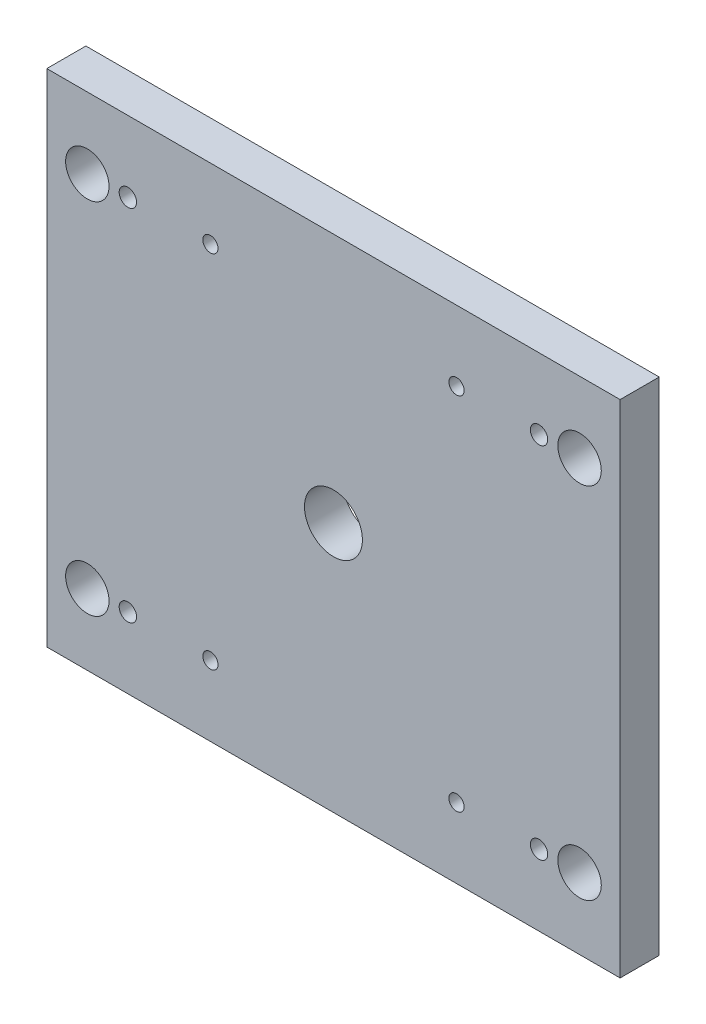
from build123d import *

# Parameters (mm, degrees)
ESQUISSE1_W          = 396
ESQUISSE1_H          = 346
BOSS_EXTRU_1_DEPTH   = 27
PER_AGE1_D           = 10.5
PER_AGE1_CBORE_D     = 17
PER_AGE1_CBORE_DEPTH = 11
PER_AGE2_D           = 10.5
PER_AGE2_CBORE_D     = 17
PER_AGE2_CBORE_DEPTH = 11
PER_AGE3_D           = 10.5
PER_AGE3_CBORE_D     = 17
PER_AGE3_CBORE_DEPTH = 11
PER_AGE4_D           = 10.5
PER_AGE4_CBORE_D     = 17
PER_AGE4_CBORE_DEPTH = 11
PER_AGE5_D           = 40
PER_AGE6_D           = 12
PER_AGE6_CBORE_D     = 18
PER_AGE6_CBORE_DEPTH = 15.5
PER_AGE7_D           = 12
PER_AGE7_CBORE_D     = 18
PER_AGE7_CBORE_DEPTH = 15.5
PER_AGE8_D           = 12
PER_AGE8_CBORE_D     = 18
PER_AGE8_CBORE_DEPTH = 15.5
PER_AGE9_D           = 12
PER_AGE9_CBORE_D     = 18
PER_AGE9_CBORE_DEPTH = 15.5
PER_AGE10_D          = 30
PER_AGE11_D          = 30
PER_AGE12_D          = 30
PER_AGE13_D          = 30


with BuildPart() as part:
    # Esquisse1 → Boss.-Extru.1 (new body)
    with BuildSketch(Plane(origin=(0, 0, -195), x_dir=(-1, 0, 0), z_dir=(0, 0, -1))):
        Rectangle(ESQUISSE1_W, ESQUISSE1_H)
    extrude(amount=-BOSS_EXTRU_1_DEPTH)

    # Per_age1 (through all)
    with Locations(Plane(origin=(0, 0, -195), x_dir=(-1, 0, 0), z_dir=(0, 0, -1))):
        with Locations((-85, -124.5)):
            CounterBoreHole(PER_AGE1_D / 2, PER_AGE1_CBORE_D / 2, PER_AGE1_CBORE_DEPTH)

    # Per_age2 (through all)
    with Locations(Plane(origin=(0, 0, -195), x_dir=(-1, 0, 0), z_dir=(0, 0, -1))):
        with Locations((85, -124.5)):
            CounterBoreHole(PER_AGE2_D / 2, PER_AGE2_CBORE_D / 2, PER_AGE2_CBORE_DEPTH)

    # Per_age3 (through all)
    with Locations(Plane(origin=(0, 0, -195), x_dir=(-1, 0, 0), z_dir=(0, 0, -1))):
        with Locations((85, 124.5)):
            CounterBoreHole(PER_AGE3_D / 2, PER_AGE3_CBORE_D / 2, PER_AGE3_CBORE_DEPTH)

    # Per_age4 (through all)
    with Locations(Plane(origin=(0, 0, -195), x_dir=(-1, 0, 0), z_dir=(0, 0, -1))):
        with Locations((-85, 124.5)):
            CounterBoreHole(PER_AGE4_D / 2, PER_AGE4_CBORE_D / 2, PER_AGE4_CBORE_DEPTH)

    # Per_age5 (through all)
    with Locations(Plane(origin=(0, 0, -195), x_dir=(-1, 0, 0), z_dir=(0, 0, -1))):
        with Locations((0, 0)):
            Hole(PER_AGE5_D / 2)

    # Per_age6 (through all)
    with Locations(Plane(origin=(0, 0, -195), x_dir=(-1, 0, 0), z_dir=(0, 0, -1))):
        with Locations((-142, 124)):
            CounterBoreHole(PER_AGE6_D / 2, PER_AGE6_CBORE_D / 2, PER_AGE6_CBORE_DEPTH)

    # Per_age7 (through all)
    with Locations(Plane(origin=(0, 0, -195), x_dir=(-1, 0, 0), z_dir=(0, 0, -1))):
        with Locations((142, -124)):
            CounterBoreHole(PER_AGE7_D / 2, PER_AGE7_CBORE_D / 2, PER_AGE7_CBORE_DEPTH)

    # Per_age8 (through all)
    with Locations(Plane(origin=(0, 0, -195), x_dir=(-1, 0, 0), z_dir=(0, 0, -1))):
        with Locations((142, 124)):
            CounterBoreHole(PER_AGE8_D / 2, PER_AGE8_CBORE_D / 2, PER_AGE8_CBORE_DEPTH)

    # Per_age9 (through all)
    with Locations(Plane(origin=(0, 0, -195), x_dir=(-1, 0, 0), z_dir=(0, 0, -1))):
        with Locations((-142, -124)):
            CounterBoreHole(PER_AGE9_D / 2, PER_AGE9_CBORE_D / 2, PER_AGE9_CBORE_DEPTH)

    # Per_age10 (through all)
    with Locations(Plane.XY.offset(-168)):
        with Locations((170, 124)):
            Hole(PER_AGE10_D / 2)

    # Per_age11 (through all)
    with Locations(Plane.XY.offset(-168)):
        with Locations((-170, 124)):
            Hole(PER_AGE11_D / 2)

    # Per_age12 (through all)
    with Locations(Plane.XY.offset(-168)):
        with Locations((-170, -124)):
            Hole(PER_AGE12_D / 2)

    # Per_age13 (through all)
    with Locations(Plane.XY.offset(-168)):
        with Locations((170, -124)):
            Hole(PER_AGE13_D / 2)


solid = part.part
